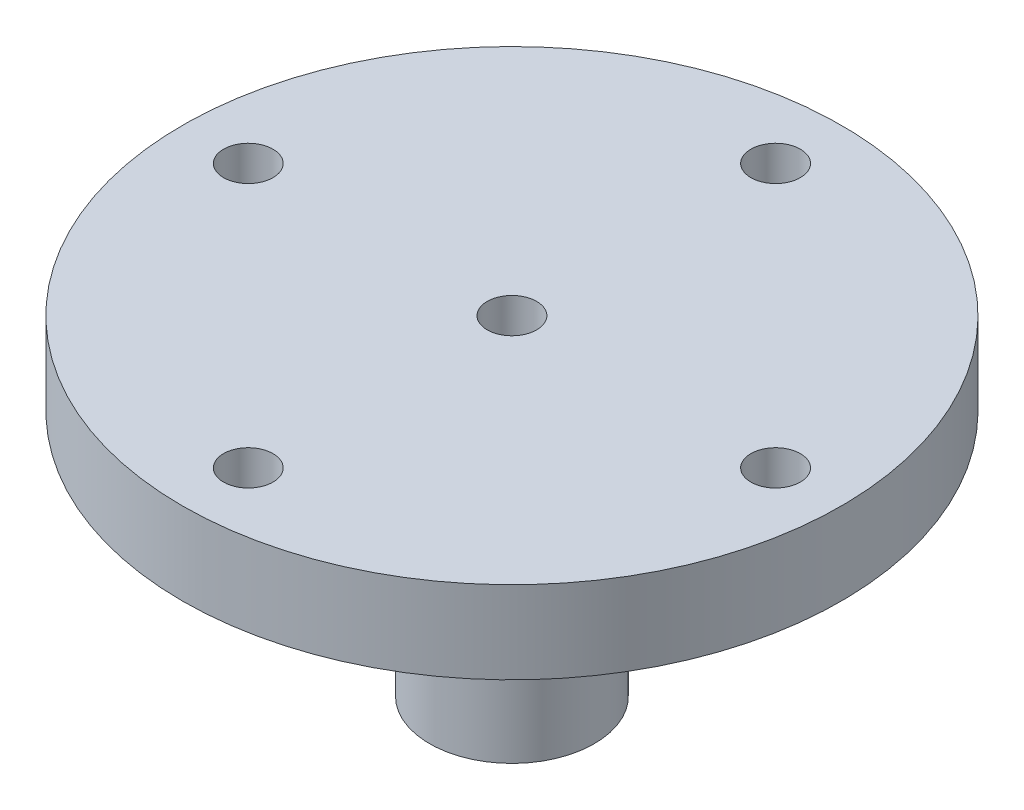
from build123d import *

# Parameters (mm, degrees)
SKETCH_1_R          = 20
SKETCH_1_R_2        = 1.5
EXTRUDE_1_DEPTH     = 5
SKETCH_2_R          = 5
EXTRUDE_2_DEPTH     = 15
SKETCH_3_R          = 10
EXTRUDE_3_DEPTH     = 3
CUT_EXTRUDE_1_REACH = 36.641
SKETCH_4_R          = 1.5


with BuildPart() as part:
    # Sketch 1 → Extrude 1 (new body)
    with BuildSketch(Plane(origin=(0, 0, 0), x_dir=(1, 0, 0), z_dir=(0, 1, 0))):
        with Locations(Location((0, 0, 0), (0, 0, 270))):
            Circle(SKETCH_1_R)
        with Locations(Location((0, -16, 0), (0, 0, 270))):
            Circle(SKETCH_1_R_2, mode=Mode.SUBTRACT)
        with Locations(Location((-16, 0, 0), (0, 0, 270))):
            Circle(SKETCH_1_R_2, mode=Mode.SUBTRACT)
        with Locations(Location((0, 16, 0), (0, 0, 270))):
            Circle(SKETCH_1_R_2, mode=Mode.SUBTRACT)
        with Locations(Location((16, 0, 0), (0, 0, 270))):
            Circle(SKETCH_1_R_2, mode=Mode.SUBTRACT)
    extrude(amount=EXTRUDE_1_DEPTH)

    # Sketch 2 → Extrude 2 (add)
    with BuildSketch(Plane.XZ):
        with Locations(Location((0, 0, 0), (0, 0, 90))):
            Circle(SKETCH_2_R)
    extrude(amount=EXTRUDE_2_DEPTH)

    # Sketch 3 → Extrude 3 (add)
    with BuildSketch(Plane.XZ):
        with Locations(Location((0, 0, 0), (0, 0, 90))):
            Circle(SKETCH_3_R)
    extrude(amount=EXTRUDE_3_DEPTH)

    # Sketch 4 → Cut-Extrude 1 (cut, up to next)
    with BuildSketch(Plane.XZ.offset(15), mode=Mode.PRIVATE) as cut_extrude_1_sk1:
        with Locations(Location((0, 0, 0), (0, 0, 270))):
            Circle(SKETCH_4_R)
    cut_extrude_1_tool1 = extrude(cut_extrude_1_sk1.sketch, amount=-CUT_EXTRUDE_1_REACH, mode=Mode.PRIVATE) & part.part
    add(cut_extrude_1_tool1.solids().sort_by_distance((0, -15, 0))[0], mode=Mode.SUBTRACT)


solid = part.part
